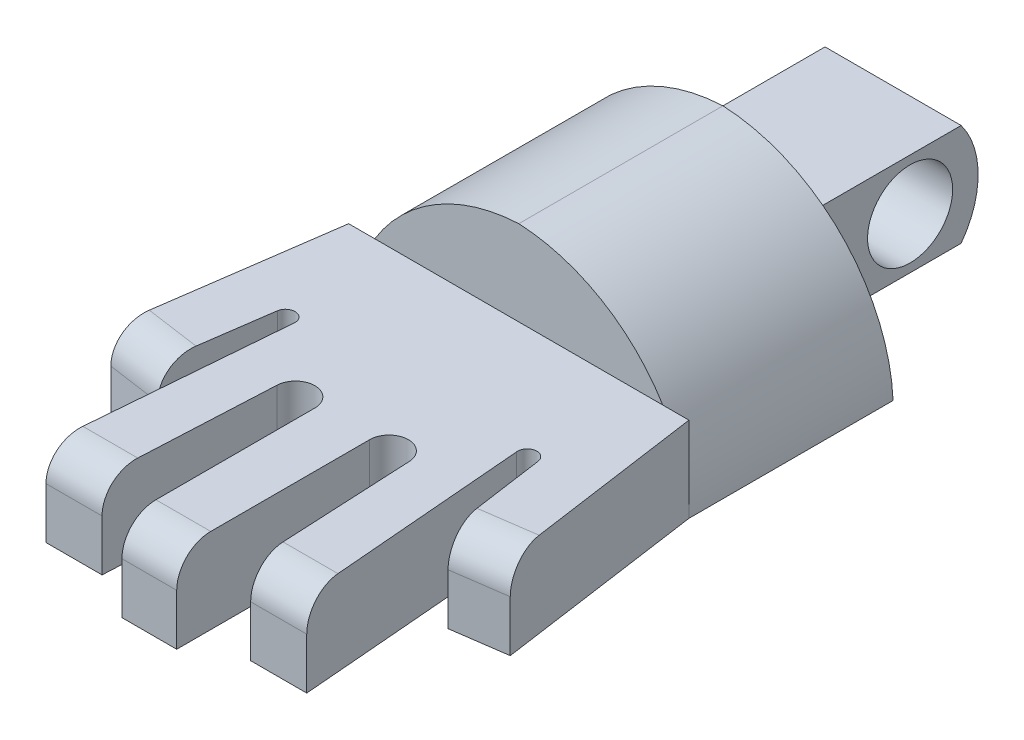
from build123d import *

# Parameters (mm, degrees)
SALIENTE_EXTRUIR1_DEPTH      = 12
SALIENTE_EXTRUIR2_DEPTH      = 4
SALIENTE_EXTRUIR2_DEPTH_BACK = 4
CROQUIS3_R                   = 2.5
SALIENTE_EXTRUIR3_DEPTH      = 4
SALIENTE_EXTRUIR3_DEPTH_BACK = 4
CROQUIS4_R                   = 2
SALIENTE_EXTRUIR4_DEPTH      = 5
REDONDEO2_R                  = 2


with BuildPart() as part:
    # Croquis1 → Saliente-Extruir1 (new body)
    with BuildSketch(Plane.XY):
        with BuildLine():
            Line((10, 0), (-10, 0))
            ThreePointArc((-10, 0), (-6.937538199, 6.937538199), (0, 10))
            ThreePointArc((0, 10), (6.937538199, 6.937538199), (10, 0))
        make_face()
    extrude(amount=SALIENTE_EXTRUIR1_DEPTH)

    # Croquis3 → Saliente-Extruir2 (add, two sides: drawn at the far end of the back side and taken through both)
    with BuildSketch(Plane(origin=(0, 0, 0), x_dir=(0, 0, -1), z_dir=(1, 0, 0)).offset(-SALIENTE_EXTRUIR2_DEPTH_BACK)):
        with BuildLine():
            Line((0, 0), (10, 0))
            ThreePointArc((10, 0), (11, 3), (10, 6))
            Line((10, 6), (0, 6))
            Line((0, 6), (0, 0))
        make_face()
        with Locations((7, 3)):
            Circle(CROQUIS3_R, mode=Mode.SUBTRACT)
    extrude(amount=SALIENTE_EXTRUIR2_DEPTH + SALIENTE_EXTRUIR2_DEPTH_BACK)

    # Croquis4 → Saliente-Extruir3 (add, two sides: drawn at the far end of the back side and taken through both)
    with BuildSketch(Plane(origin=(0, 0, 0), x_dir=(0, 0, -1), z_dir=(1, 0, 0)).offset(-SALIENTE_EXTRUIR3_DEPTH_BACK)):
        with Locations((-9.5, 3)):
            Circle(CROQUIS4_R)
    extrude(amount=SALIENTE_EXTRUIR3_DEPTH + SALIENTE_EXTRUIR3_DEPTH_BACK)

    # Croquis5 → Saliente-Extruir4 (add)
    with BuildSketch(Plane(origin=(0, 0, 0), x_dir=(1, 0, 0), z_dir=(0, 1, 0))):
        with BuildLine():
            Line((-10, -12), (-11.738022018, -24.240567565))
            Line((-11.738022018, -24.240567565), (-8.538196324, -24.694906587))
            Line((-8.538196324, -24.694906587), (-7.662969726, -18.530847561))
            ThreePointArc((-7.662969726, -18.530847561), (-7.02737416, -18.053305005), (-6.549831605, -18.688900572))
            Line((-6.549831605, -18.688900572), (-7.662969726, -32.126834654))
            Line((-7.662969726, -32.126834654), (-4.368557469, -32.126834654))
            Line((-4.368557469, -32.126834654), (-3.885371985, -22.319568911))
            ThreePointArc((-3.885371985, -22.319568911), (-2.720444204, -21.237776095), (-1.61045552, -22.375869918))
            Line((-1.61045552, -22.375869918), (-1.61045552, -33.716899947))
            Line((-1.61045552, -33.716899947), (1.61045552, -33.716899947))
            Line((1.61045552, -33.716899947), (1.61045552, -22.375869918))
            ThreePointArc((1.61045552, -22.375869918), (2.720444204, -21.237776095), (3.885371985, -22.319568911))
            Line((3.885371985, -22.319568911), (4.368557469, -32.126834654))
            Line((4.368557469, -32.126834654), (7.662969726, -32.126834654))
            Line((7.662969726, -32.126834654), (6.549831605, -18.688900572))
            ThreePointArc((6.549831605, -18.688900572), (7.02737416, -18.053305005), (7.662969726, -18.530847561))
            Line((7.662969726, -18.530847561), (8.538196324, -24.694906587))
            Line((8.538196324, -24.694906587), (11.738022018, -24.240567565))
            Line((11.738022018, -24.240567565), (10, -12))
            Line((10, -12), (-10, -12))
        make_face()
    extrude(amount=SALIENTE_EXTRUIR4_DEPTH)

    # Redondeo2
    redondeo2_edges = [part.edges().sort_by_distance(p)[0] for p in [
        (-10.138109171, 5, 24.467737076),
        (-6.015763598, 5, 32.126834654),
        (0, 5, 33.716899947),
        (6.015763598, 5, 32.126834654),
        (10.138109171, 5, 24.467737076),
    ]]
    fillet(redondeo2_edges, radius=REDONDEO2_R)


solid = part.part
